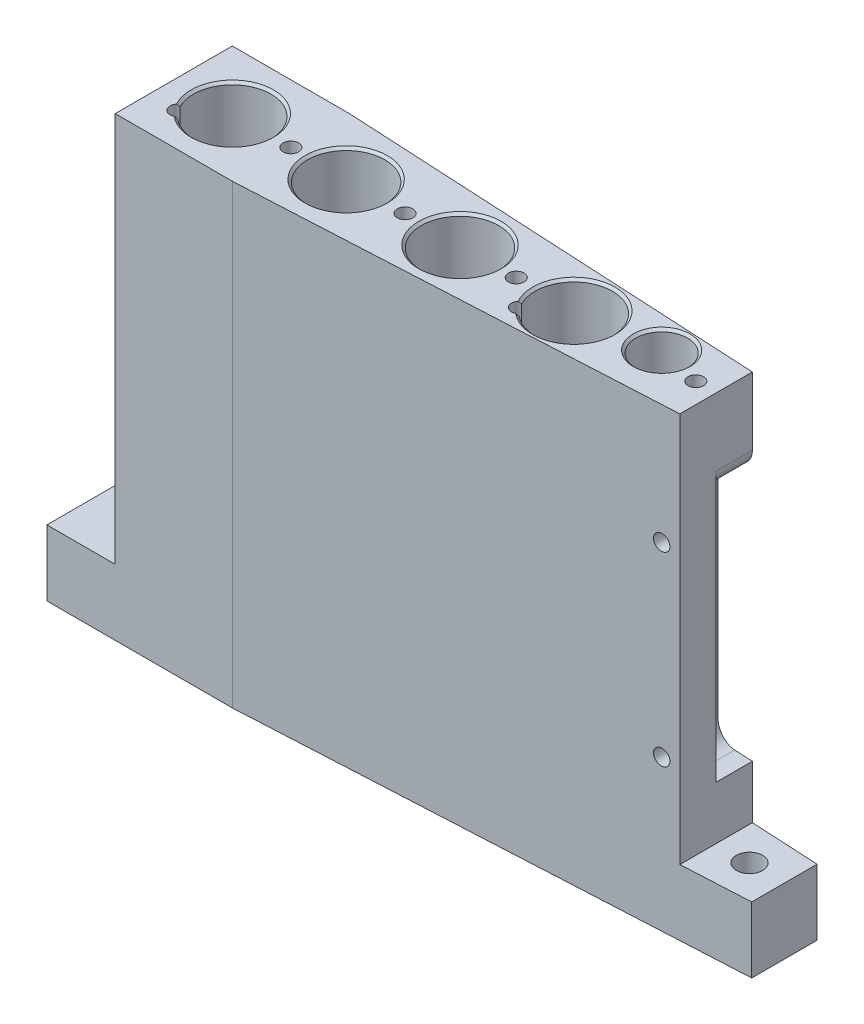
from build123d import *

# Parameters (mm, degrees)
BOSS_EXTRUDE1_DEPTH                = 46.75
F_5_16_0_3125_DIAMETER_HOLE1_D     = 7.9375
F_5_16_0_3125_DIAMETER_HOLE1_DEPTH = 41
LPATTERN1_COUNT                    = 4
LPATTERN1_PITCH                    = 11.666666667
F_4_0_209_DIAMETER_HOLE1_D         = 5.3086
SKETCH14_W                         = 12
SKETCH14_H                         = 7
SKETCH14_W_2                       = 7.43370891
CUT_EXTRUDE1_DEPTH                 = 40
M2_5_CLEARANCE_HOLE1_D             = 2.7
F_1_16_0_0625_DIAMETER_HOLE1_D     = 1.5875
F_1_16_0_0625_DIAMETER_HOLE1_DEPTH = 4.5
F_1_16_0_0625_DIAMETER_HOLE2_D     = 1.5875
F_1_16_0_0625_DIAMETER_HOLE2_DEPTH = 6.5
F_1_16_0_0625_DIAMETER_HOLE2_TIP   = 0.476933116
M2X0_4_TAPPED_HOLE2_D              = 1.6
M2X0_4_TAPPED_HOLE2_DEPTH          = 5.2
M2X0_4_TAPPED_HOLE2_TIP            = 0.480688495
F_37_0_104_DIAMETER_HOLE1_D        = 2.6416
F_37_0_104_DIAMETER_HOLE1_DEPTH    = 4
F_37_0_104_DIAMETER_HOLE1_TIP      = 0.762564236
F_1_16_0_0625_DIAMETER_HOLE3_D     = 1.5875
SKETCH39_R                         = 2.95
SKETCH39_R_2                       = 1.55
CUT_EXTRUDE3_DEPTH                 = 0.75
F_1_32_0_03125_DIAMETER_HOLE1_D    = 0.79375
SKETCH44_R                         = 2.95
SKETCH44_R_2                       = 1.55
CUT_EXTRUDE4_DEPTH                 = 0.75
CHAMFER1_SIZE                      = 0.25
SKETCH47_W                         = 3.7
SKETCH47_H                         = 25.8
CUT_EXTRUDE5_DEPTH                 = 85.041292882
M2X0_4_TAPPED_HOLE3_D              = 1.6
FILLET1_R                          = 1.8


with BuildPart() as part:
    # Sketch1 → Boss-Extrude1 (new body)
    with BuildSketch(Plane(origin=(0, 0, 0), x_dir=(1, 0, 0), z_dir=(0, 1, 0))):
        Polygon((0, 6), (0, -6), (19.014987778, -6), (69.58, -3.35), (69.58, 3.35), (19.014987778, 6), align=None)
    extrude(amount=BOSS_EXTRUDE1_DEPTH)

    # 5_16 _0.3125_ Diameter Hole1
    with Locations(Plane(origin=(-12.105298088, 46.75, 2.056471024), x_dir=(-1, 0, 0), z_dir=(0, 1, 0))):
        with Locations((-25.105298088, -2.056471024)):
            f_5_16_0_3125_diameter_hole1 = Hole(F_5_16_0_3125_DIAMETER_HOLE1_D / 2, depth=F_5_16_0_3125_DIAMETER_HOLE1_DEPTH)

    # LPattern1: 5_16 _0.3125_ Diameter Hole1 ×4
    with Locations(*[(i * LPATTERN1_PITCH, 0, 0) for i in range(1, LPATTERN1_COUNT)]):
        add(f_5_16_0_3125_diameter_hole1, mode=Mode.SUBTRACT)

    # 4 _0.209_ Diameter Hole1 (through all)
    with Locations(Plane(origin=(0, 46.75, 0), x_dir=(-1, 0, 0), z_dir=(0, 1, 0))):
        with Locations((-56, -1)):
            Hole(F_4_0_209_DIAMETER_HOLE1_D / 2)

    # Sketch14 → Cut-Extrude1 (cut)
    with BuildSketch(Plane(origin=(46.75, 46.75, 0), x_dir=(0, 0, 1), z_dir=(0, -1, 0))):
        with Locations((0, 43.25)):
            Rectangle(SKETCH14_W, SKETCH14_H)
        with Locations((0, -19.33)):
            Rectangle(SKETCH14_W_2, SKETCH14_H)
    extrude(amount=CUT_EXTRUDE1_DEPTH, mode=Mode.SUBTRACT)

    # M2.5 Clearance Hole1 (through all)
    with Locations(Plane(origin=(0, 6.75, 0), x_dir=(-1, 0, 0), z_dir=(0, 1, 0))):
        with Locations((-3.5, 0), (-66, 0)):
            Hole(M2_5_CLEARANCE_HOLE1_D / 2)

    # 1_16 _0.0625_ Diameter Hole1
    with Locations(Plane.XZ):
        with Locations((8, 0), (62, 0)):
            Hole(F_1_16_0_0625_DIAMETER_HOLE1_D / 2, depth=F_1_16_0_0625_DIAMETER_HOLE1_DEPTH)

    # 1_16 _0.0625_ Diameter Hole2
    with Locations(Plane(origin=(0, 46.75, 0), x_dir=(1, 0, 0), z_dir=(0, 1, 0))):
        with Locations((9.917634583, -2.5), (44.917634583, -2.5)):
            Hole(F_1_16_0_0625_DIAMETER_HOLE2_D / 2, depth=F_1_16_0_0625_DIAMETER_HOLE2_DEPTH)
            with Locations((0, 0, -(F_1_16_0_0625_DIAMETER_HOLE2_DEPTH + F_1_16_0_0625_DIAMETER_HOLE2_TIP / 2))):  # 118° drill point
                Cone(0, F_1_16_0_0625_DIAMETER_HOLE2_D / 2, F_1_16_0_0625_DIAMETER_HOLE2_TIP, mode=Mode.SUBTRACT)

    # M2x0.4 Tapped Hole2
    with Locations(Plane(origin=(0, 46.75, 0), x_dir=(1, 0, 0), z_dir=(0, 1, 0))):
        with Locations((19, 0), (30.7, 0), (42.1, 0), (60.5, 0)):
            Hole(M2X0_4_TAPPED_HOLE2_D / 2, depth=M2X0_4_TAPPED_HOLE2_DEPTH)
            with Locations((0, 0, -(M2X0_4_TAPPED_HOLE2_DEPTH + M2X0_4_TAPPED_HOLE2_TIP / 2))):  # 118° drill point
                Cone(0, M2X0_4_TAPPED_HOLE2_D / 2, M2X0_4_TAPPED_HOLE2_TIP, mode=Mode.SUBTRACT)

    # Sketch38 → Cut-Revolve2 (revolve, cut)
    with BuildSketch(Plane.XY):
        with BuildLine():
            Line((11.1, 10.58125), (11.1, 5.81875))
            ThreePointArc((11.1, 5.81875), (8.71875, 8.2), (11.1, 10.58125))
        make_face()
    revolve(axis=Axis((11.1, 12.795563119, 0), (0, -1, 0)), mode=Mode.SUBTRACT)

    # 37 _0.104_ Diameter Hole1
    with Locations(Plane(origin=(0, 0, 0), x_dir=(-1, 0, 0), z_dir=(0, -1, 0))):
        with Locations((-26.67, 1.5), (-34.33, 1.5), (-38.33, 1.5), (-48.7, 0.8), (-13, 0)):
            Hole(F_37_0_104_DIAMETER_HOLE1_D / 2, depth=F_37_0_104_DIAMETER_HOLE1_DEPTH)
            with Locations((0, 0, -(F_37_0_104_DIAMETER_HOLE1_DEPTH + F_37_0_104_DIAMETER_HOLE1_TIP / 2))):  # 120° drill point
                Cone(0, F_37_0_104_DIAMETER_HOLE1_D / 2, F_37_0_104_DIAMETER_HOLE1_TIP, mode=Mode.SUBTRACT)

    # 1_16 _0.0625_ Diameter Hole3 (through all)
    with Locations(Plane(origin=(0, 0, 0), x_dir=(-1, 0, 0), z_dir=(0, -1, 0))):
        with Locations((-13, 0)):
            Hole(F_1_16_0_0625_DIAMETER_HOLE3_D / 2)

    # Sketch39 → Cut-Extrude3 (cut)
    # profile 1 of 2: a face of its own
    with BuildSketch(Plane.XZ):
        with Locations(Location((13, 0, 0), (0, 0, 270))):
            Circle(SKETCH39_R)
        with Locations(Location((13, 0, 0), (0, 0, 270))):
            Circle(SKETCH39_R_2, mode=Mode.SUBTRACT)
    # profile 2 of 2: a face of its own
    with BuildSketch(Plane.XZ):
        with Locations(Location((48.7, -0.8, 0), (0, 0, 270))):
            Circle(SKETCH39_R)
        with Locations(Location((48.7, -0.8, 0), (0, 0, 270))):
            Circle(SKETCH39_R_2, mode=Mode.SUBTRACT)
    extrude(amount=-CUT_EXTRUDE3_DEPTH, mode=Mode.SUBTRACT)

    # 1_32 _0.03125_ Diameter Hole1 (through all)
    with Locations(Plane(origin=(0, 0, 0), x_dir=(-1, 0, 0), z_dir=(0, -1, 0))):
        with Locations((-38.33, 1.5), (-34.33, 1.5), (-26.67, 1.5), (-48.7, 0.8)):
            Hole(F_1_32_0_03125_DIAMETER_HOLE1_D / 2)

    # Sketch44 → Cut-Extrude4 (cut)
    # profile 1 of 2: a face of its own
    with BuildSketch(Plane.XZ):
        with Locations(Location((26.67, -1.5, 0), (0, 0, 270))):
            Circle(SKETCH44_R)
        with Locations(Location((26.67, -1.5, 0), (0, 0, 270))):
            Circle(SKETCH44_R_2, mode=Mode.SUBTRACT)
    # profile 2 of 2: a face of its own
    with BuildSketch(Plane.XZ):
        with BuildLine():
            Line((34.33, 1.55), (38.33, 1.55))
            ThreePointArc((38.33, 1.55), (41.38, -1.5), (38.33, -4.55))
            Line((38.33, -4.55), (34.33, -4.55))
            ThreePointArc((34.33, -4.55), (31.28, -1.5), (34.33, 1.55))
        make_face()
        with BuildLine():
            Line((34.33, 0.25), (38.33, 0.25))
            ThreePointArc((38.33, 0.25), (40.08, -1.5), (38.33, -3.25))
            Line((38.33, -3.25), (34.33, -3.25))
            ThreePointArc((34.33, -3.25), (32.58, -1.5), (34.33, 0.25))
        make_face(mode=Mode.SUBTRACT)
    extrude(amount=-CUT_EXTRUDE4_DEPTH, mode=Mode.SUBTRACT)

    # Chamfer1
    chamfer1_edges = [part.edges().sort_by_distance(p)[0] for p in [
        (12.054464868, 46.75, -3.854470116),
        (20.697916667, 46.75, 0),
        (32.364583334, 46.75, 0),
        (53.3457, 46.75, -1),
        (47.054464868, 46.75, -3.854470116),
    ]]
    chamfer(chamfer1_edges, length=CHAMFER1_SIZE)

    # Sketch47 → Cut-Extrude5 (cut, through all)
    with BuildSketch(Plane.XY):
        with Locations((60.73, 25.1)):
            Rectangle(SKETCH47_W, SKETCH47_H)
    extrude(amount=-CUT_EXTRUDE5_DEPTH, mode=Mode.SUBTRACT)

    # M2x0.4 Tapped Hole3 (through all)
    with Locations(Plane(origin=(0, 0, 0), x_dir=(-1, 0, 0), z_dir=(0, 0, -1))):
        with Locations((-60.815, 34.505), (-60.815, 15.455)):
            Hole(M2X0_4_TAPPED_HOLE3_D / 2)

    # Fillet1
    fillet1_edges = [part.edges().sort_by_distance(p)[0] for p in [
        (62.58, 38, -1.858427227),
        (58.88, 12.2, -1.955381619),
        (58.88, 38, -1.955381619),
    ]]
    fillet(fillet1_edges, radius=FILLET1_R)


solid = part.part
